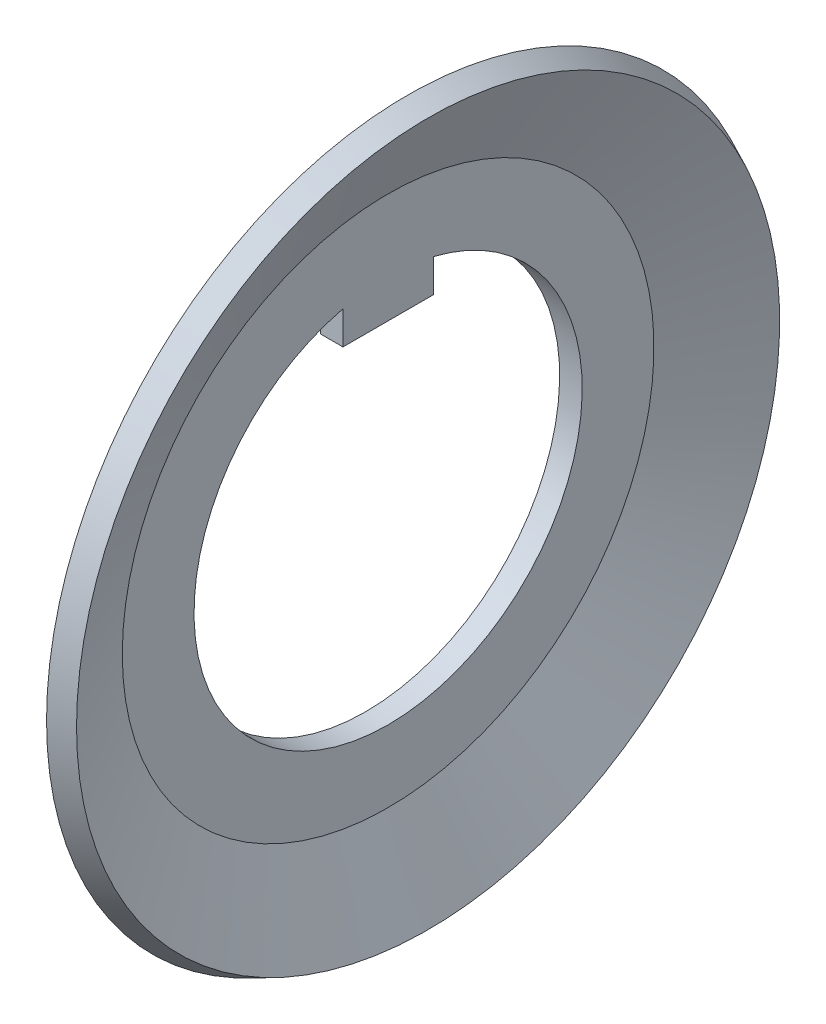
from build123d import *

# Parameters (mm, degrees)
ESQUISSE3_W      = 4
ESQUISSE3_H      = 2.788988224
EXTRUSION1_DEPTH = 1


with BuildPart() as part:
    # Esquisse1 → R_volution1 (revolve)
    with BuildSketch(Plane.XY, mode=Mode.PRIVATE) as r_volution1_sk:
        Polygon((0, 8.6), (0, 12), (1.865230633, 16), (2.77153842, 15.577381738), (1, 11.778305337), (1, 8.6), align=None)
    revolve(r_volution1_sk.sketch.rotate(Axis((0, 0, 0), (1, 0, 0)), 90), axis=Axis((0, 0, 0), (1, 0, 0)))

    # Esquisse3 → Extrusion1 (add)
    with BuildSketch(Plane.ZY):
        with Locations((0, 8.294494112)):
            Rectangle(ESQUISSE3_W, ESQUISSE3_H)
    extrude(amount=-EXTRUSION1_DEPTH)


solid = part.part
